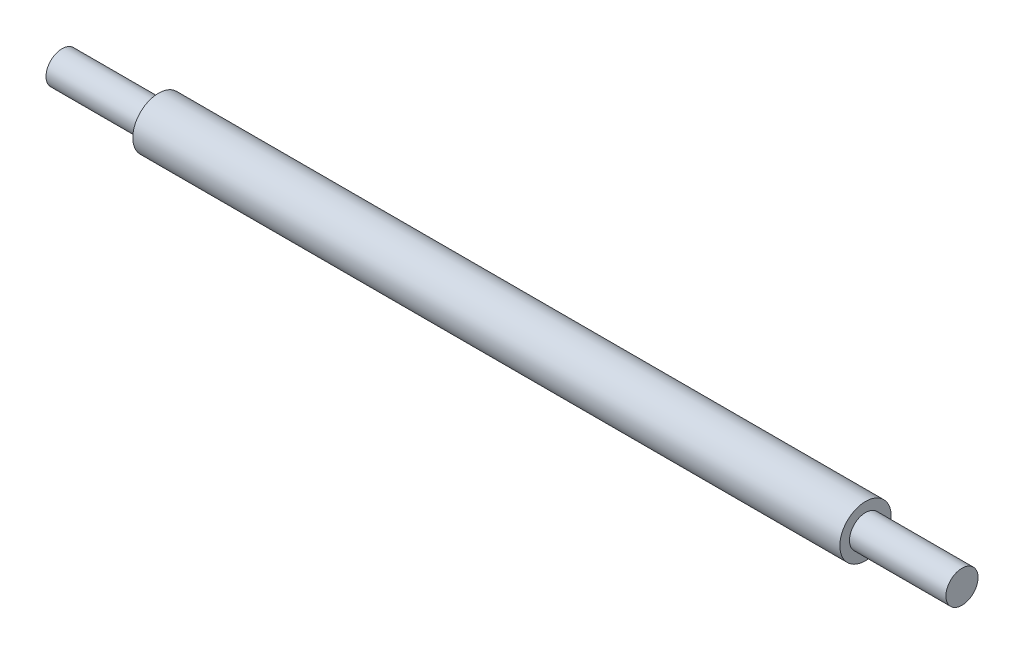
from build123d import *


with BuildPart() as part:
    # Sketch1 → Revolve1 (revolve)
    with BuildSketch(Plane.XY, mode=Mode.PRIVATE) as revolve1_sk:
        Polygon((0, 0), (0, 1.5875), (9.525, 1.5875), (9.525, 2.54), (79.375, 2.54), (79.375, 1.5875), (88.9, 1.5875), (88.9, 0), align=None)
    revolve(revolve1_sk.sketch.rotate(Axis((0, 0, 0), (1, 0, 0)), 90), axis=Axis((0, 0, 0), (1, 0, 0)))


solid = part.part
